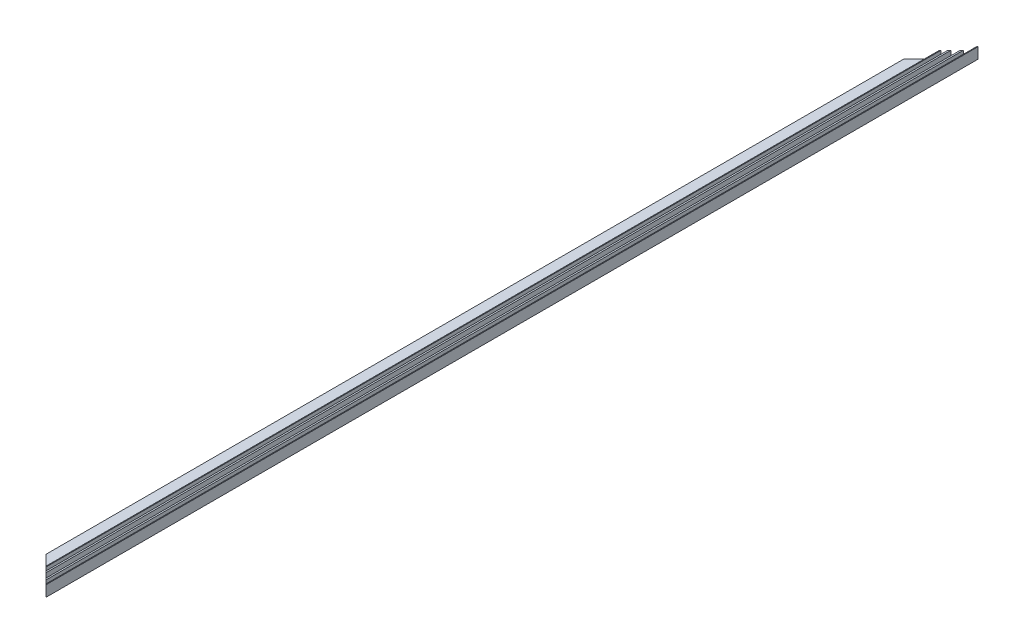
from build123d import *

# Parameters (mm, degrees)
Y_KSEKLIK_EKSTR_ZYON1_DEPTH = 600
KES_EKSTR_ZYON1_DEPTH       = 600
KES_EKSTR_ZYON2_DEPTH       = 600


with BuildPart() as part:
    # izim2 → Y_kseklik-Ekstr_zyon1 (new body)
    with BuildSketch(Plane.XY):
        Polygon((-63.15540885, 0), (-51.15540885, 0), (-51.15540885, 0.5), (-39.15540885, 0.5), (-39.15540885, 7.5), (-39.65540885, 7.5), (-39.65540885, 5.5), (-40.65540885, 5.5), (-40.65540885, 1), (-43.85540885, 1), (-43.85540885, 5.5), (-44.85540885, 5.5), (-44.85540885, 1), (-47.85540885, 1), (-47.85540885, 5.5), (-48.85540885, 5.5), (-48.85540885, 1), (-51.05540885, 1), (-51.05540885, 5.5), (-51.55540885, 5.5), (-51.55540885, 0.505753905), (-63.15540885, 0.505753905), align=None)
    extrude(amount=Y_KSEKLIK_EKSTR_ZYON1_DEPTH)

    # izim3 → Kes-Ekstr_zyon1 (cut)
    with BuildSketch(Plane.XZ):
        Polygon((-39.15540885, 0), (-63.15540885, 24), (-63.15540885, 0), align=None)
    extrude(amount=-KES_EKSTR_ZYON1_DEPTH, mode=Mode.SUBTRACT)

    # izim5 → Kes-Ekstr_zyon2 (cut)
    with BuildSketch(Plane.XZ):
        Polygon((-39.15540885, 600), (-63.15540885, 576), (-63.15540885, 600), align=None)
    extrude(amount=-KES_EKSTR_ZYON2_DEPTH, mode=Mode.SUBTRACT)


solid = part.part
